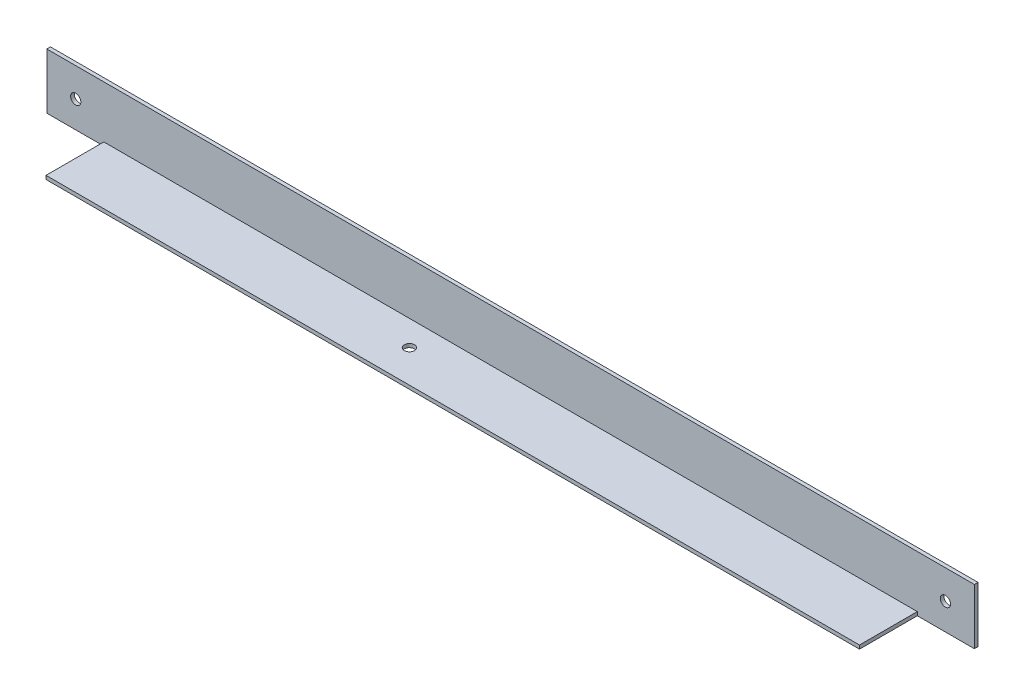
ISO-10303-21;
HEADER;
FILE_DESCRIPTION(('STEP AP214'),'2;1');
FILE_NAME('part.step','',(''),(''),'','','');
FILE_SCHEMA(('AUTOMOTIVE_DESIGN { 1 0 10303 214 1 1 1 1 }'));
ENDSEC;
DATA;
#1=APPLICATION_CONTEXT('core data for automotive mechanical design processes');
#2=APPLICATION_PROTOCOL_DEFINITION('international standard','automotive_design',2000,#1);
#3=PRODUCT_CONTEXT('',#1,'mechanical');
#4=PRODUCT('Part','Part','',(#3));
#5=PRODUCT_RELATED_PRODUCT_CATEGORY('part','',(#4));
#6=PRODUCT_DEFINITION_FORMATION('','',#4);
#7=PRODUCT_DEFINITION_CONTEXT('part definition',#1,'design');
#8=PRODUCT_DEFINITION('design','',#6,#7);
#9=PRODUCT_DEFINITION_SHAPE('','',#8);
#10=(LENGTH_UNIT() NAMED_UNIT(*) SI_UNIT(.MILLI.,.METRE.));
#11=(NAMED_UNIT(*) PLANE_ANGLE_UNIT() SI_UNIT($,.RADIAN.));
#12=(NAMED_UNIT(*) SI_UNIT($,.STERADIAN.) SOLID_ANGLE_UNIT());
#13=UNCERTAINTY_MEASURE_WITH_UNIT(LENGTH_MEASURE(1.E-05),#10,'distance_accuracy_value','');
#14=(GEOMETRIC_REPRESENTATION_CONTEXT(3) GLOBAL_UNCERTAINTY_ASSIGNED_CONTEXT((#13)) GLOBAL_UNIT_ASSIGNED_CONTEXT((#10,
#11,#12)) REPRESENTATION_CONTEXT('',''));
#15=CARTESIAN_POINT('',(0.,0.,0.));
#16=DIRECTION('',(0.,0.,1.));
#17=DIRECTION('',(1.,0.,0.));
#18=AXIS2_PLACEMENT_3D('',#15,#16,#17);
#19=CARTESIAN_POINT('',(0.,0.,26.924));
#20=DIRECTION('',(0.,0.,1.));
#21=DIRECTION('',(1.,0.,0.));
#22=AXIS2_PLACEMENT_3D('',#19,#20,#21);
#23=PLANE('',#22);
#24=DIRECTION('',(0.,1.,0.));
#25=VECTOR('',#24,1.);
#26=CARTESIAN_POINT('',(-184.826086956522,42.5020093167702,26.924));
#27=LINE('',#26,#25);
#28=CARTESIAN_POINT('',(-184.826086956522,43.4545093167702,26.924));
#29=VERTEX_POINT('',#28);
#30=CARTESIAN_POINT('',(-184.826086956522,45.0420093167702,26.924));
#31=VERTEX_POINT('',#30);
#32=EDGE_CURVE('E55',#29,#31,#27,.T.);
#33=ORIENTED_EDGE('',*,*,#32,.F.);
#34=DIRECTION('',(1.,0.,0.));
#35=VECTOR('',#34,1.);
#36=CARTESIAN_POINT('',(-209.826086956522,43.4545093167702,26.924));
#37=LINE('',#36,#35);
#38=CARTESIAN_POINT('',(171.573913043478,43.4545093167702,26.924));
#39=VERTEX_POINT('',#38);
#40=EDGE_CURVE('E139',#29,#39,#37,.T.);
#41=ORIENTED_EDGE('',*,*,#40,.T.);
#42=DIRECTION('',(0.,1.,0.));
#43=VECTOR('',#42,1.);
#44=CARTESIAN_POINT('',(171.573913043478,42.5020093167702,26.924));
#45=LINE('',#44,#43);
#46=CARTESIAN_POINT('',(171.573913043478,45.0420093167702,26.924));
#47=VERTEX_POINT('',#46);
#48=EDGE_CURVE('E237',#39,#47,#45,.T.);
#49=ORIENTED_EDGE('',*,*,#48,.T.);
#50=DIRECTION('',(1.,0.,0.));
#51=VECTOR('',#50,1.);
#52=CARTESIAN_POINT('',(-209.826086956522,45.0420093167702,26.924));
#53=LINE('',#52,#51);
#54=EDGE_CURVE('E127',#31,#47,#53,.T.);
#55=ORIENTED_EDGE('',*,*,#54,.F.);
#56=EDGE_LOOP('',(#33,#41,#49,#55));
#57=FACE_BOUND('',#56,.T.);
#58=ADVANCED_FACE('F38',(#57),#23,.T.);
#59=CARTESIAN_POINT('',(-209.826086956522,67.8385093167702,26.924));
#60=DIRECTION('',(1.,0.,0.));
#61=DIRECTION('',(0.,0.,-1.));
#62=AXIS2_PLACEMENT_3D('',#59,#60,#61);
#63=PLANE('',#62);
#64=DIRECTION('',(0.,0.,-1.));
#65=VECTOR('',#64,1.);
#66=CARTESIAN_POINT('',(-209.826086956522,43.4545093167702,26.924));
#67=LINE('',#66,#65);
#68=CARTESIAN_POINT('',(-209.826086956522,43.4545093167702,1.5875));
#69=VERTEX_POINT('',#68);
#70=CARTESIAN_POINT('',(-209.826086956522,43.4545093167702,0.));
#71=VERTEX_POINT('',#70);
#72=EDGE_CURVE('E11',#69,#71,#67,.T.);
#73=ORIENTED_EDGE('',*,*,#72,.F.);
#74=DIRECTION('',(0.,1.,0.));
#75=VECTOR('',#74,1.);
#76=CARTESIAN_POINT('',(-209.826086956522,55.1385093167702,1.5875));
#77=LINE('',#76,#75);
#78=CARTESIAN_POINT('',(-209.826086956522,67.8385093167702,1.5875));
#79=VERTEX_POINT('',#78);
#80=EDGE_CURVE('E135',#69,#79,#77,.T.);
#81=ORIENTED_EDGE('',*,*,#80,.T.);
#82=DIRECTION('',(0.,0.,-1.));
#83=VECTOR('',#82,1.);
#84=CARTESIAN_POINT('',(-209.826086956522,67.8385093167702,26.924));
#85=LINE('',#84,#83);
#86=CARTESIAN_POINT('',(-209.826086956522,67.8385093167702,0.));
#87=VERTEX_POINT('',#86);
#88=EDGE_CURVE('E63',#79,#87,#85,.T.);
#89=ORIENTED_EDGE('',*,*,#88,.T.);
#90=DIRECTION('',(0.,-1.,0.));
#91=VECTOR('',#90,1.);
#92=CARTESIAN_POINT('',(-209.826086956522,67.8385093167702,0.));
#93=LINE('',#92,#91);
#94=EDGE_CURVE('E137',#87,#71,#93,.T.);
#95=ORIENTED_EDGE('',*,*,#94,.T.);
#96=EDGE_LOOP('',(#73,#81,#89,#95));
#97=FACE_BOUND('',#96,.T.);
#98=ADVANCED_FACE('F40',(#97),#63,.F.);
#99=CARTESIAN_POINT('',(-209.826086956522,43.4545093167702,26.924));
#100=DIRECTION('',(0.,1.,0.));
#101=DIRECTION('',(0.,0.,1.));
#102=AXIS2_PLACEMENT_3D('',#99,#100,#101);
#103=PLANE('',#102);
#104=CARTESIAN_POINT('',(-39.8260869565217,43.4545093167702,12.7000000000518));
#105=DIRECTION('',(0.,-1.,0.));
#106=DIRECTION('',(0.,0.,-1.));
#107=AXIS2_PLACEMENT_3D('',#104,#105,#106);
#108=CIRCLE('',#107,2.23392999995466);
#109=CARTESIAN_POINT('',(-39.8260869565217,43.4545093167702,10.4660700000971));
#110=VERTEX_POINT('',#109);
#111=EDGE_CURVE('E208',#110,#110,#108,.T.);
#112=ORIENTED_EDGE('',*,*,#111,.F.);
#113=EDGE_LOOP('',(#112));
#114=FACE_BOUND('',#113,.T.);
#115=DIRECTION('',(0.,0.,-1.));
#116=VECTOR('',#115,1.);
#117=CARTESIAN_POINT('',(-184.826086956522,43.4545093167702,26.924));
#118=LINE('',#117,#116);
#119=CARTESIAN_POINT('',(-184.826086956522,43.4545093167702,1.58750000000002));
#120=VERTEX_POINT('',#119);
#121=EDGE_CURVE('E210',#29,#120,#118,.T.);
#122=ORIENTED_EDGE('',*,*,#121,.T.);
#123=DIRECTION('',(-1.,0.,0.));
#124=VECTOR('',#123,1.);
#125=CARTESIAN_POINT('',(-209.826086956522,43.4545093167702,1.5875));
#126=LINE('',#125,#124);
#127=EDGE_CURVE('E113',#120,#69,#126,.T.);
#128=ORIENTED_EDGE('',*,*,#127,.T.);
#129=ORIENTED_EDGE('',*,*,#72,.T.);
#130=DIRECTION('',(1.,0.,0.));
#131=VECTOR('',#130,1.);
#132=CARTESIAN_POINT('',(-209.826086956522,43.4545093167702,0.));
#133=LINE('',#132,#131);
#134=CARTESIAN_POINT('',(196.573913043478,43.4545093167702,0.));
#135=VERTEX_POINT('',#134);
#136=EDGE_CURVE('E144',#71,#135,#133,.T.);
#137=ORIENTED_EDGE('',*,*,#136,.T.);
#138=DIRECTION('',(0.,0.,-1.));
#139=VECTOR('',#138,1.);
#140=CARTESIAN_POINT('',(196.573913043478,43.4545093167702,26.924));
#141=LINE('',#140,#139);
#142=CARTESIAN_POINT('',(196.573913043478,43.4545093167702,1.58750000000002));
#143=VERTEX_POINT('',#142);
#144=EDGE_CURVE('E47',#143,#135,#141,.T.);
#145=ORIENTED_EDGE('',*,*,#144,.F.);
#146=DIRECTION('',(-1.,0.,0.));
#147=VECTOR('',#146,1.);
#148=CARTESIAN_POINT('',(-209.826086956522,43.4545093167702,1.58750000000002));
#149=LINE('',#148,#147);
#150=CARTESIAN_POINT('',(171.573913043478,43.4545093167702,1.58750000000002));
#151=VERTEX_POINT('',#150);
#152=EDGE_CURVE('E115',#143,#151,#149,.T.);
#153=ORIENTED_EDGE('',*,*,#152,.T.);
#154=DIRECTION('',(0.,0.,1.));
#155=VECTOR('',#154,1.);
#156=CARTESIAN_POINT('',(171.573913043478,43.4545093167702,26.9239999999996));
#157=LINE('',#156,#155);
#158=EDGE_CURVE('E213',#151,#39,#157,.T.);
#159=ORIENTED_EDGE('',*,*,#158,.T.);
#160=ORIENTED_EDGE('',*,*,#40,.F.);
#161=EDGE_LOOP('',(#122,#128,#129,#137,#145,#153,#159,#160));
#162=FACE_BOUND('',#161,.T.);
#163=ADVANCED_FACE('F184',(#114,#162),#103,.F.);
#164=CARTESIAN_POINT('',(196.573913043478,67.8385093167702,26.924));
#165=DIRECTION('',(-1.,0.,0.));
#166=DIRECTION('',(0.,0.,1.));
#167=AXIS2_PLACEMENT_3D('',#164,#165,#166);
#168=PLANE('',#167);
#169=DIRECTION('',(0.,1.,0.));
#170=VECTOR('',#169,1.);
#171=CARTESIAN_POINT('',(196.573913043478,55.1385093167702,1.5875));
#172=LINE('',#171,#170);
#173=CARTESIAN_POINT('',(196.573913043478,67.8385093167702,1.5875));
#174=VERTEX_POINT('',#173);
#175=EDGE_CURVE('E129',#143,#174,#172,.T.);
#176=ORIENTED_EDGE('',*,*,#175,.F.);
#177=ORIENTED_EDGE('',*,*,#144,.T.);
#178=DIRECTION('',(0.,1.,0.));
#179=VECTOR('',#178,1.);
#180=CARTESIAN_POINT('',(196.573913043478,67.8385093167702,0.));
#181=LINE('',#180,#179);
#182=CARTESIAN_POINT('',(196.573913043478,67.8385093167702,0.));
#183=VERTEX_POINT('',#182);
#184=EDGE_CURVE('E147',#135,#183,#181,.T.);
#185=ORIENTED_EDGE('',*,*,#184,.T.);
#186=DIRECTION('',(0.,0.,-1.));
#187=VECTOR('',#186,1.);
#188=CARTESIAN_POINT('',(196.573913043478,67.8385093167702,26.924));
#189=LINE('',#188,#187);
#190=EDGE_CURVE('E152',#174,#183,#189,.T.);
#191=ORIENTED_EDGE('',*,*,#190,.F.);
#192=EDGE_LOOP('',(#176,#177,#185,#191));
#193=FACE_BOUND('',#192,.T.);
#194=ADVANCED_FACE('F195',(#193),#168,.F.);
#195=CARTESIAN_POINT('',(-209.826086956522,67.8385093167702,26.924));
#196=DIRECTION('',(0.,-1.,0.));
#197=DIRECTION('',(0.,0.,-1.));
#198=AXIS2_PLACEMENT_3D('',#195,#196,#197);
#199=PLANE('',#198);
#200=ORIENTED_EDGE('',*,*,#88,.F.);
#201=DIRECTION('',(-1.,0.,0.));
#202=VECTOR('',#201,1.);
#203=CARTESIAN_POINT('',(-209.826086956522,67.8385093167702,1.5875));
#204=LINE('',#203,#202);
#205=EDGE_CURVE('E126',#174,#79,#204,.T.);
#206=ORIENTED_EDGE('',*,*,#205,.F.);
#207=ORIENTED_EDGE('',*,*,#190,.T.);
#208=DIRECTION('',(-1.,0.,0.));
#209=VECTOR('',#208,1.);
#210=CARTESIAN_POINT('',(-209.826086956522,67.8385093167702,0.));
#211=LINE('',#210,#209);
#212=EDGE_CURVE('E142',#183,#87,#211,.T.);
#213=ORIENTED_EDGE('',*,*,#212,.T.);
#214=EDGE_LOOP('',(#200,#206,#207,#213));
#215=FACE_BOUND('',#214,.T.);
#216=ADVANCED_FACE('F191',(#215),#199,.F.);
#217=CARTESIAN_POINT('',(0.,0.,0.));
#218=DIRECTION('',(0.,0.,1.));
#219=DIRECTION('',(1.,0.,0.));
#220=AXIS2_PLACEMENT_3D('',#217,#218,#219);
#221=PLANE('',#220);
#222=CARTESIAN_POINT('',(183.873913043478,55.1385093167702,0.));
#223=DIRECTION('',(0.,0.,-1.));
#224=DIRECTION('',(-1.,0.,0.));
#225=AXIS2_PLACEMENT_3D('',#222,#223,#224);
#226=CIRCLE('',#225,2.23499999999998);
#227=CARTESIAN_POINT('',(181.638913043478,55.1385093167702,0.));
#228=VERTEX_POINT('',#227);
#229=EDGE_CURVE('E157',#228,#228,#226,.T.);
#230=ORIENTED_EDGE('',*,*,#229,.F.);
#231=EDGE_LOOP('',(#230));
#232=FACE_BOUND('',#231,.T.);
#233=CARTESIAN_POINT('',(-197.126086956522,55.1385093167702,0.));
#234=DIRECTION('',(0.,0.,-1.));
#235=DIRECTION('',(1.,0.,0.));
#236=AXIS2_PLACEMENT_3D('',#233,#234,#235);
#237=CIRCLE('',#236,2.23499999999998);
#238=CARTESIAN_POINT('',(-194.891086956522,55.1385093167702,0.));
#239=VERTEX_POINT('',#238);
#240=EDGE_CURVE('E215',#239,#239,#237,.T.);
#241=ORIENTED_EDGE('',*,*,#240,.F.);
#242=EDGE_LOOP('',(#241));
#243=FACE_BOUND('',#242,.T.);
#244=ORIENTED_EDGE('',*,*,#94,.F.);
#245=ORIENTED_EDGE('',*,*,#212,.F.);
#246=ORIENTED_EDGE('',*,*,#184,.F.);
#247=ORIENTED_EDGE('',*,*,#136,.F.);
#248=EDGE_LOOP('',(#244,#245,#246,#247));
#249=FACE_BOUND('',#248,.T.);
#250=ADVANCED_FACE('F188',(#232,#243,#249),#221,.F.);
#251=CARTESIAN_POINT('',(-209.826086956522,55.1385093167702,1.5875));
#252=DIRECTION('',(0.,0.,-1.));
#253=DIRECTION('',(-1.,0.,0.));
#254=AXIS2_PLACEMENT_3D('',#251,#252,#253);
#255=PLANE('',#254);
#256=CARTESIAN_POINT('',(183.873913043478,55.1385093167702,1.5875));
#257=DIRECTION('',(0.,0.,-1.));
#258=DIRECTION('',(-1.,0.,0.));
#259=AXIS2_PLACEMENT_3D('',#256,#257,#258);
#260=CIRCLE('',#259,2.23499999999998);
#261=CARTESIAN_POINT('',(181.638913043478,55.1385093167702,1.5875));
#262=VERTEX_POINT('',#261);
#263=EDGE_CURVE('E131',#262,#262,#260,.T.);
#264=ORIENTED_EDGE('',*,*,#263,.T.);
#265=EDGE_LOOP('',(#264));
#266=FACE_BOUND('',#265,.T.);
#267=CARTESIAN_POINT('',(-197.126086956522,55.1385093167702,1.5875));
#268=DIRECTION('',(0.,0.,-1.));
#269=DIRECTION('',(-1.,0.,0.));
#270=AXIS2_PLACEMENT_3D('',#267,#268,#269);
#271=CIRCLE('',#270,2.23499999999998);
#272=CARTESIAN_POINT('',(-199.361086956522,55.1385093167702,1.5875));
#273=VERTEX_POINT('',#272);
#274=EDGE_CURVE('E155',#273,#273,#271,.T.);
#275=ORIENTED_EDGE('',*,*,#274,.T.);
#276=EDGE_LOOP('',(#275));
#277=FACE_BOUND('',#276,.T.);
#278=ORIENTED_EDGE('',*,*,#205,.T.);
#279=ORIENTED_EDGE('',*,*,#80,.F.);
#280=ORIENTED_EDGE('',*,*,#127,.F.);
#281=DIRECTION('',(0.,1.,0.));
#282=VECTOR('',#281,1.);
#283=CARTESIAN_POINT('',(-184.826086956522,42.5020093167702,1.58750000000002));
#284=LINE('',#283,#282);
#285=CARTESIAN_POINT('',(-184.826086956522,45.0420093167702,1.58750000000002));
#286=VERTEX_POINT('',#285);
#287=EDGE_CURVE('E107',#120,#286,#284,.T.);
#288=ORIENTED_EDGE('',*,*,#287,.T.);
#289=DIRECTION('',(1.,0.,0.));
#290=VECTOR('',#289,1.);
#291=CARTESIAN_POINT('',(-209.826086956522,45.0420093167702,1.58750000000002));
#292=LINE('',#291,#290);
#293=CARTESIAN_POINT('',(171.573913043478,45.0420093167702,1.58750000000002));
#294=VERTEX_POINT('',#293);
#295=EDGE_CURVE('E111',#286,#294,#292,.T.);
#296=ORIENTED_EDGE('',*,*,#295,.T.);
#297=DIRECTION('',(0.,1.,0.));
#298=VECTOR('',#297,1.);
#299=CARTESIAN_POINT('',(171.573913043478,42.5020093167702,1.58750000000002));
#300=LINE('',#299,#298);
#301=EDGE_CURVE('E234',#151,#294,#300,.T.);
#302=ORIENTED_EDGE('',*,*,#301,.F.);
#303=ORIENTED_EDGE('',*,*,#152,.F.);
#304=ORIENTED_EDGE('',*,*,#175,.T.);
#305=EDGE_LOOP('',(#278,#279,#280,#288,#296,#302,#303,#304));
#306=FACE_BOUND('',#305,.T.);
#307=ADVANCED_FACE('F108',(#266,#277,#306),#255,.F.);
#308=CARTESIAN_POINT('',(-209.826086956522,45.0420093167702,-404.93789811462));
#309=DIRECTION('',(0.,-1.,0.));
#310=DIRECTION('',(0.,0.,-1.));
#311=AXIS2_PLACEMENT_3D('',#308,#309,#310);
#312=PLANE('',#311);
#313=CARTESIAN_POINT('',(-39.8260869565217,45.0420093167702,12.7000000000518));
#314=DIRECTION('',(0.,-1.,0.));
#315=DIRECTION('',(0.,0.,-1.));
#316=AXIS2_PLACEMENT_3D('',#313,#314,#315);
#317=CIRCLE('',#316,2.23392999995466);
#318=CARTESIAN_POINT('',(-39.8260869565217,45.0420093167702,10.4660700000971));
#319=VERTEX_POINT('',#318);
#320=EDGE_CURVE('E42',#319,#319,#317,.T.);
#321=ORIENTED_EDGE('',*,*,#320,.T.);
#322=EDGE_LOOP('',(#321));
#323=FACE_BOUND('',#322,.T.);
#324=ORIENTED_EDGE('',*,*,#295,.F.);
#325=DIRECTION('',(0.,0.,-1.));
#326=VECTOR('',#325,1.);
#327=CARTESIAN_POINT('',(-184.826086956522,45.0420093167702,1.58750000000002));
#328=LINE('',#327,#326);
#329=EDGE_CURVE('E117',#31,#286,#328,.T.);
#330=ORIENTED_EDGE('',*,*,#329,.F.);
#331=ORIENTED_EDGE('',*,*,#54,.T.);
#332=DIRECTION('',(0.,0.,1.));
#333=VECTOR('',#332,1.);
#334=CARTESIAN_POINT('',(171.573913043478,45.0420093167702,26.924));
#335=LINE('',#334,#333);
#336=EDGE_CURVE('E122',#294,#47,#335,.T.);
#337=ORIENTED_EDGE('',*,*,#336,.F.);
#338=EDGE_LOOP('',(#324,#330,#331,#337));
#339=FACE_BOUND('',#338,.T.);
#340=ADVANCED_FACE('F125',(#323,#339),#312,.F.);
#341=CARTESIAN_POINT('',(-197.126086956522,55.1385093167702,2.54));
#342=DIRECTION('',(0.,0.,-1.));
#343=DIRECTION('',(-1.,0.,0.));
#344=AXIS2_PLACEMENT_3D('',#341,#342,#343);
#345=CYLINDRICAL_SURFACE('',#344,2.23499999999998);
#346=ORIENTED_EDGE('',*,*,#240,.T.);
#347=EDGE_LOOP('',(#346));
#348=FACE_BOUND('',#347,.T.);
#349=ORIENTED_EDGE('',*,*,#274,.F.);
#350=EDGE_LOOP('',(#349));
#351=FACE_BOUND('',#350,.T.);
#352=ADVANCED_FACE('F166',(#348,#351),#345,.F.);
#353=CARTESIAN_POINT('',(183.873913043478,55.1385093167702,2.54));
#354=DIRECTION('',(0.,0.,-1.));
#355=DIRECTION('',(-1.,0.,0.));
#356=AXIS2_PLACEMENT_3D('',#353,#354,#355);
#357=CYLINDRICAL_SURFACE('',#356,2.23499999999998);
#358=ORIENTED_EDGE('',*,*,#229,.T.);
#359=EDGE_LOOP('',(#358));
#360=FACE_BOUND('',#359,.T.);
#361=ORIENTED_EDGE('',*,*,#263,.F.);
#362=EDGE_LOOP('',(#361));
#363=FACE_BOUND('',#362,.T.);
#364=ADVANCED_FACE('F163',(#360,#363),#357,.F.);
#365=CARTESIAN_POINT('',(171.573913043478,42.5020093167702,26.924));
#366=DIRECTION('',(-1.,0.,0.));
#367=DIRECTION('',(0.,0.,1.));
#368=AXIS2_PLACEMENT_3D('',#365,#366,#367);
#369=PLANE('',#368);
#370=ORIENTED_EDGE('',*,*,#301,.T.);
#371=ORIENTED_EDGE('',*,*,#336,.T.);
#372=ORIENTED_EDGE('',*,*,#48,.F.);
#373=ORIENTED_EDGE('',*,*,#158,.F.);
#374=EDGE_LOOP('',(#370,#371,#372,#373));
#375=FACE_BOUND('',#374,.T.);
#376=ADVANCED_FACE('F165',(#375),#369,.F.);
#377=CARTESIAN_POINT('',(-184.826086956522,42.5020093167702,1.58750000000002));
#378=DIRECTION('',(1.,0.,0.));
#379=DIRECTION('',(0.,0.,-1.));
#380=AXIS2_PLACEMENT_3D('',#377,#378,#379);
#381=PLANE('',#380);
#382=ORIENTED_EDGE('',*,*,#32,.T.);
#383=ORIENTED_EDGE('',*,*,#329,.T.);
#384=ORIENTED_EDGE('',*,*,#287,.F.);
#385=ORIENTED_EDGE('',*,*,#121,.F.);
#386=EDGE_LOOP('',(#382,#383,#384,#385));
#387=FACE_BOUND('',#386,.T.);
#388=ADVANCED_FACE('F118',(#387),#381,.F.);
#389=CARTESIAN_POINT('',(-39.8260869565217,53.4545093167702,12.7000000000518));
#390=DIRECTION('',(0.,-1.,0.));
#391=DIRECTION('',(0.,0.,-1.));
#392=AXIS2_PLACEMENT_3D('',#389,#390,#391);
#393=CYLINDRICAL_SURFACE('',#392,2.23392999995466);
#394=ORIENTED_EDGE('',*,*,#111,.T.);
#395=EDGE_LOOP('',(#394));
#396=FACE_BOUND('',#395,.T.);
#397=ORIENTED_EDGE('',*,*,#320,.F.);
#398=EDGE_LOOP('',(#397));
#399=FACE_BOUND('',#398,.T.);
#400=ADVANCED_FACE('F247',(#396,#399),#393,.F.);
#401=CLOSED_SHELL('',(#58,#98,#163,#194,#216,#250,#307,#340,#352,#364,#376,#388,#400));
#402=MANIFOLD_SOLID_BREP('B2',#401);
#403=ADVANCED_BREP_SHAPE_REPRESENTATION('',(#18,#402),#14);
#404=SHAPE_DEFINITION_REPRESENTATION(#9,#403);
ENDSEC;
END-ISO-10303-21;
